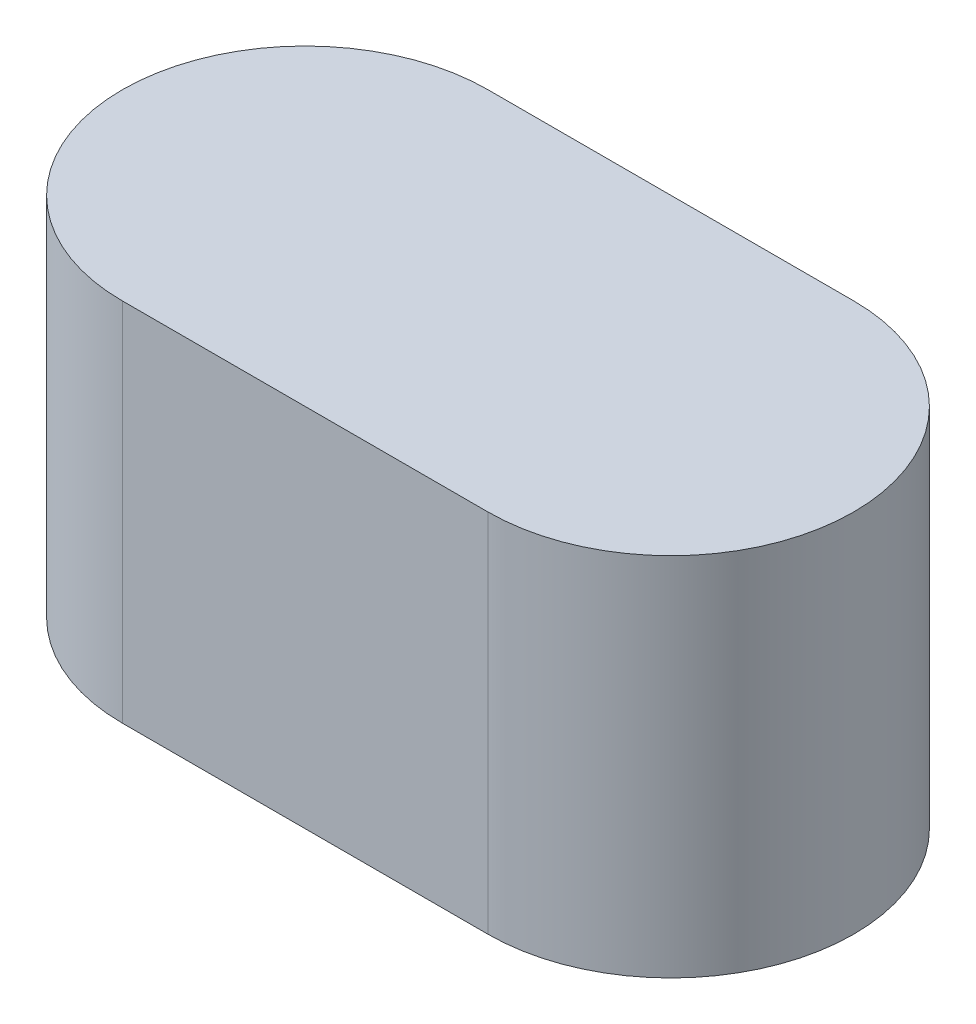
from build123d import *

# Parameters (mm, degrees)
EXTRUSION1_DEPTH      = 2.5
EXTRUSION1_DEPTH_BACK = 2.5


with BuildPart() as part:
    # Esquisse1 → Extrusion1 (new, two sides: drawn at the far end of the back side and taken through both)
    with BuildSketch(Plane(origin=(0, 0, 0), x_dir=(1, 0, 0), z_dir=(0, 1, 0)).offset(-EXTRUSION1_DEPTH_BACK)):
        with BuildLine():
            Line((-2.5, 2.5), (2.5, 2.5))
            ThreePointArc((2.5, 2.5), (5, 0), (2.5, -2.5))
            Line((2.5, -2.5), (-2.5, -2.5))
            ThreePointArc((-2.5, -2.5), (-5, 0), (-2.5, 2.5))
        make_face()
    extrude(amount=EXTRUSION1_DEPTH + EXTRUSION1_DEPTH_BACK)


solid = part.part
